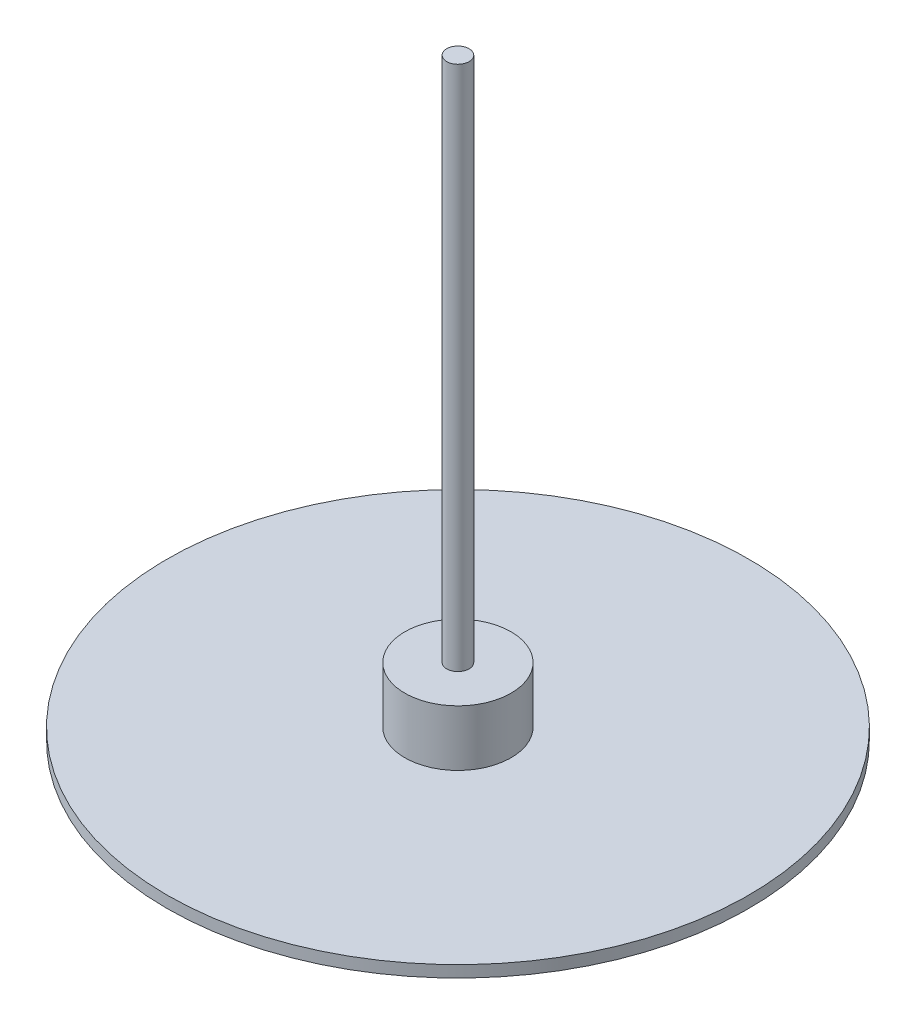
from build123d import *

# Parameters (mm, degrees)
SKETCH2_R           = 3.175
BOSS_EXTRUDE2_DEPTH = 149.225
SKETCH3_R           = 15.08125
BOSS_EXTRUDE3_DEPTH = 15.875
SKETCH5_R           = 82.55
BOSS_EXTRUDE5_DEPTH = 3.302


with BuildPart() as part:
    # Sketch2 → Boss-Extrude2 (new body)
    with BuildSketch(Plane(origin=(0, 0, 0), x_dir=(1, 0, 0), z_dir=(0, 1, 0))):
        with Locations(Location((0, 0, 0), (0, 0, 270))):
            Circle(SKETCH2_R)
    extrude(amount=BOSS_EXTRUDE2_DEPTH)

    # Sketch3 → Boss-Extrude3 (add)
    with BuildSketch(Plane(origin=(0, 0, 0), x_dir=(-1, 0, 0), z_dir=(0, -1, 0))):
        with Locations(Location((0, 0, 0), (0, 0, 90))):
            Circle(SKETCH3_R)
    extrude(amount=BOSS_EXTRUDE3_DEPTH)

    # Sketch5 → Boss-Extrude5 (add)
    with BuildSketch(Plane(origin=(0, -15.875, 0), x_dir=(-1, 0, 0), z_dir=(0, -1, 0))):
        with Locations(Location((0, 0, 0), (0, 0, 270))):
            Circle(SKETCH5_R)
    extrude(amount=BOSS_EXTRUDE5_DEPTH)


solid = part.part
